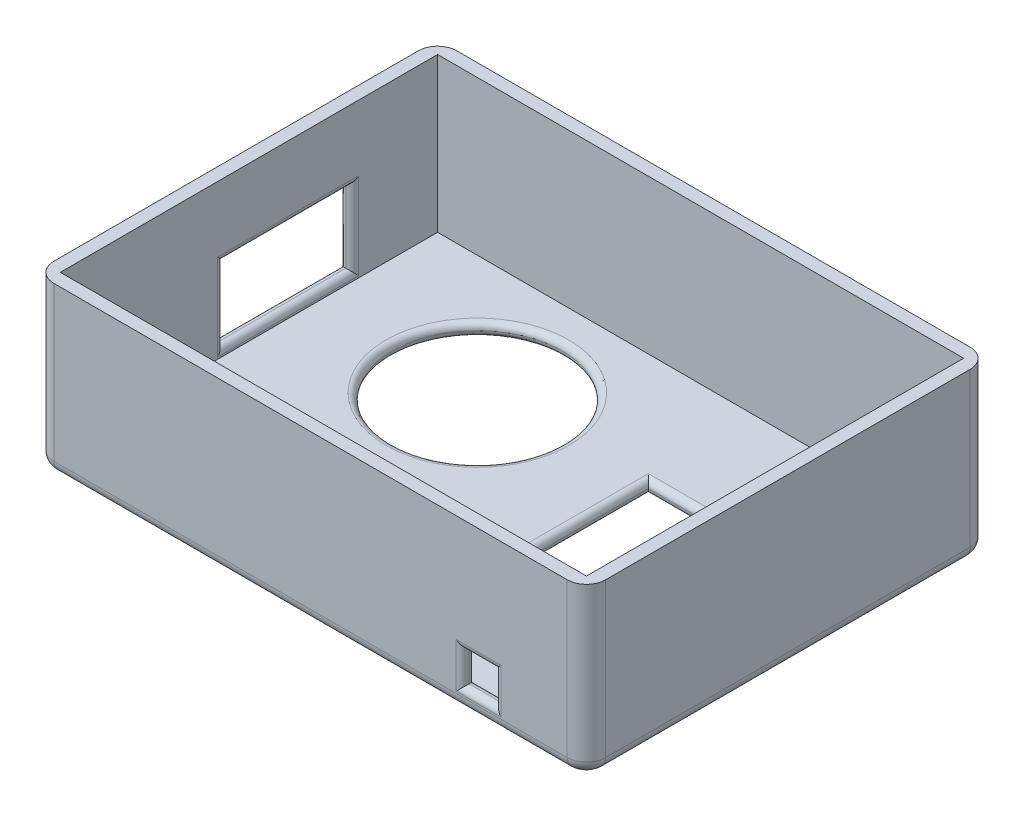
ISO-10303-21;
HEADER;
FILE_DESCRIPTION(('STEP AP214'),'2;1');
FILE_NAME('part.step','',(''),(''),'','','');
FILE_SCHEMA(('AUTOMOTIVE_DESIGN { 1 0 10303 214 1 1 1 1 }'));
ENDSEC;
DATA;
#1=APPLICATION_CONTEXT('core data for automotive mechanical design processes');
#2=APPLICATION_PROTOCOL_DEFINITION('international standard','automotive_design',2000,#1);
#3=PRODUCT_CONTEXT('',#1,'mechanical');
#4=PRODUCT('Part','Part','',(#3));
#5=PRODUCT_RELATED_PRODUCT_CATEGORY('part','',(#4));
#6=PRODUCT_DEFINITION_FORMATION('','',#4);
#7=PRODUCT_DEFINITION_CONTEXT('part definition',#1,'design');
#8=PRODUCT_DEFINITION('design','',#6,#7);
#9=PRODUCT_DEFINITION_SHAPE('','',#8);
#10=(LENGTH_UNIT() NAMED_UNIT(*) SI_UNIT(.MILLI.,.METRE.));
#11=(NAMED_UNIT(*) PLANE_ANGLE_UNIT() SI_UNIT($,.RADIAN.));
#12=(NAMED_UNIT(*) SI_UNIT($,.STERADIAN.) SOLID_ANGLE_UNIT());
#13=UNCERTAINTY_MEASURE_WITH_UNIT(LENGTH_MEASURE(1.E-05),#10,'distance_accuracy_value','');
#14=(GEOMETRIC_REPRESENTATION_CONTEXT(3) GLOBAL_UNCERTAINTY_ASSIGNED_CONTEXT((#13)) GLOBAL_UNIT_ASSIGNED_CONTEXT((#10,
#11,#12)) REPRESENTATION_CONTEXT('',''));
#15=CARTESIAN_POINT('',(0.,0.,0.));
#16=DIRECTION('',(0.,0.,1.));
#17=DIRECTION('',(1.,0.,0.));
#18=AXIS2_PLACEMENT_3D('',#15,#16,#17);
#19=CARTESIAN_POINT('',(0.,2.,0.));
#20=DIRECTION('',(0.,1.,0.));
#21=DIRECTION('',(0.,0.,1.));
#22=AXIS2_PLACEMENT_3D('',#19,#20,#21);
#23=PLANE('',#22);
#24=CARTESIAN_POINT('',(-24.0169790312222,2.,-11.2489790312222));
#25=DIRECTION('',(0.,1.,0.));
#26=DIRECTION('',(0.,0.,1.));
#27=AXIS2_PLACEMENT_3D('',#24,#25,#26);
#28=CIRCLE('',#27,14.2489790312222);
#29=CARTESIAN_POINT('',(-24.0169790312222,2.,3.));
#30=VERTEX_POINT('',#29);
#31=EDGE_CURVE('E997',#30,#30,#28,.F.);
#32=ORIENTED_EDGE('',*,*,#31,.T.);
#33=EDGE_LOOP('',(#32));
#34=FACE_BOUND('',#33,.T.);
#35=DIRECTION('',(0.,0.,1.));
#36=VECTOR('',#35,1.);
#37=CARTESIAN_POINT('',(0.231999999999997,2.,0.));
#38=LINE('',#37,#36);
#39=CARTESIAN_POINT('',(0.232,2.,24.));
#40=VERTEX_POINT('',#39);
#41=CARTESIAN_POINT('',(0.231999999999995,2.,-13.6479580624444));
#42=VERTEX_POINT('',#41);
#43=EDGE_CURVE('E981',#40,#42,#38,.F.);
#44=ORIENTED_EDGE('',*,*,#43,.T.);
#45=DIRECTION('',(1.,0.,0.));
#46=VECTOR('',#45,1.);
#47=CARTESIAN_POINT('',(18.732,2.,-13.6479580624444));
#48=LINE('',#47,#46);
#49=CARTESIAN_POINT('',(19.732,2.,-13.6479580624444));
#50=VERTEX_POINT('',#49);
#51=EDGE_CURVE('E993',#42,#50,#48,.T.);
#52=ORIENTED_EDGE('',*,*,#51,.T.);
#53=DIRECTION('',(0.,0.,1.));
#54=VECTOR('',#53,1.);
#55=CARTESIAN_POINT('',(19.732,2.,23.));
#56=LINE('',#55,#54);
#57=CARTESIAN_POINT('',(19.732,2.,24.));
#58=VERTEX_POINT('',#57);
#59=EDGE_CURVE('E989',#50,#58,#56,.T.);
#60=ORIENTED_EDGE('',*,*,#59,.T.);
#61=DIRECTION('',(1.,0.,0.));
#62=VECTOR('',#61,1.);
#63=CARTESIAN_POINT('',(0.,2.,24.));
#64=LINE('',#63,#62);
#65=EDGE_CURVE('E985',#58,#40,#64,.F.);
#66=ORIENTED_EDGE('',*,*,#65,.T.);
#67=EDGE_LOOP('',(#44,#52,#60,#66));
#68=FACE_BOUND('',#67,.T.);
#69=DIRECTION('',(0.,0.,-1.));
#70=VECTOR('',#69,1.);
#71=CARTESIAN_POINT('',(-48.768,2.,0.));
#72=LINE('',#71,#70);
#73=CARTESIAN_POINT('',(-48.768,2.00000000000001,29.));
#74=VERTEX_POINT('',#73);
#75=CARTESIAN_POINT('',(-48.768,2.,-29.7979580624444));
#76=VERTEX_POINT('',#75);
#77=EDGE_CURVE('E807',#74,#76,#72,.T.);
#78=ORIENTED_EDGE('',*,*,#77,.F.);
#79=DIRECTION('',(-1.,0.,0.));
#80=VECTOR('',#79,1.);
#81=CARTESIAN_POINT('',(0.,2.,29.));
#82=LINE('',#81,#80);
#83=CARTESIAN_POINT('',(33.232,2.00000000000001,29.));
#84=VERTEX_POINT('',#83);
#85=EDGE_CURVE('E811',#84,#74,#82,.T.);
#86=ORIENTED_EDGE('',*,*,#85,.F.);
#87=DIRECTION('',(0.,0.,-1.));
#88=VECTOR('',#87,1.);
#89=CARTESIAN_POINT('',(33.232,2.,0.));
#90=LINE('',#89,#88);
#91=CARTESIAN_POINT('',(33.232,2.00000000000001,-29.7979580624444));
#92=VERTEX_POINT('',#91);
#93=EDGE_CURVE('E815',#84,#92,#90,.T.);
#94=ORIENTED_EDGE('',*,*,#93,.T.);
#95=DIRECTION('',(-1.,0.,0.));
#96=VECTOR('',#95,1.);
#97=CARTESIAN_POINT('',(0.,2.,-29.7979580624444));
#98=LINE('',#97,#96);
#99=EDGE_CURVE('E819',#92,#76,#98,.T.);
#100=ORIENTED_EDGE('',*,*,#99,.T.);
#101=EDGE_LOOP('',(#78,#86,#94,#100));
#102=FACE_BOUND('',#101,.T.);
#103=ADVANCED_FACE('F43',(#34,#68,#102),#23,.T.);
#104=CARTESIAN_POINT('',(0.,0.,0.));
#105=DIRECTION('',(0.,1.,0.));
#106=DIRECTION('',(0.,0.,1.));
#107=AXIS2_PLACEMENT_3D('',#104,#105,#106);
#108=PLANE('',#107);
#109=CARTESIAN_POINT('',(-24.0169790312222,0.,-11.2489790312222));
#110=DIRECTION('',(0.,1.,0.));
#111=DIRECTION('',(0.,0.,1.));
#112=AXIS2_PLACEMENT_3D('',#109,#110,#111);
#113=CIRCLE('',#112,14.2489790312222);
#114=CARTESIAN_POINT('',(-24.0169790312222,0.,3.));
#115=VERTEX_POINT('',#114);
#116=EDGE_CURVE('E1047',#115,#115,#113,.T.);
#117=ORIENTED_EDGE('',*,*,#116,.T.);
#118=EDGE_LOOP('',(#117));
#119=FACE_BOUND('',#118,.T.);
#120=DIRECTION('',(0.,0.,1.));
#121=VECTOR('',#120,1.);
#122=CARTESIAN_POINT('',(19.732,0.,0.));
#123=LINE('',#122,#121);
#124=CARTESIAN_POINT('',(19.732,0.,24.));
#125=VERTEX_POINT('',#124);
#126=CARTESIAN_POINT('',(19.732,0.,-13.6479580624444));
#127=VERTEX_POINT('',#126);
#128=EDGE_CURVE('E973',#125,#127,#123,.F.);
#129=ORIENTED_EDGE('',*,*,#128,.T.);
#130=DIRECTION('',(1.,0.,0.));
#131=VECTOR('',#130,1.);
#132=CARTESIAN_POINT('',(0.,0.,-13.6479580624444));
#133=LINE('',#132,#131);
#134=CARTESIAN_POINT('',(0.231999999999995,0.,-13.6479580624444));
#135=VERTEX_POINT('',#134);
#136=EDGE_CURVE('E977',#127,#135,#133,.F.);
#137=ORIENTED_EDGE('',*,*,#136,.T.);
#138=DIRECTION('',(0.,0.,1.));
#139=VECTOR('',#138,1.);
#140=CARTESIAN_POINT('',(0.232,0.,23.));
#141=LINE('',#140,#139);
#142=CARTESIAN_POINT('',(0.232,0.,24.));
#143=VERTEX_POINT('',#142);
#144=EDGE_CURVE('E933',#135,#143,#141,.T.);
#145=ORIENTED_EDGE('',*,*,#144,.T.);
#146=DIRECTION('',(1.,0.,0.));
#147=VECTOR('',#146,1.);
#148=CARTESIAN_POINT('',(18.732,0.,24.));
#149=LINE('',#148,#147);
#150=EDGE_CURVE('E969',#143,#125,#149,.T.);
#151=ORIENTED_EDGE('',*,*,#150,.T.);
#152=EDGE_LOOP('',(#129,#137,#145,#151));
#153=FACE_BOUND('',#152,.T.);
#154=CARTESIAN_POINT('',(-47.768,0.,28.));
#155=DIRECTION('',(0.,1.,0.));
#156=DIRECTION('',(0.,0.,1.));
#157=AXIS2_PLACEMENT_3D('',#154,#155,#156);
#158=CIRCLE('',#157,1.);
#159=CARTESIAN_POINT('',(-47.768,0.,29.));
#160=VERTEX_POINT('',#159);
#161=CARTESIAN_POINT('',(-48.768,0.,28.));
#162=VERTEX_POINT('',#161);
#163=EDGE_CURVE('E893',#160,#162,#158,.F.);
#164=ORIENTED_EDGE('',*,*,#163,.T.);
#165=DIRECTION('',(0.,0.,1.));
#166=VECTOR('',#165,1.);
#167=CARTESIAN_POINT('',(-48.768,0.,0.));
#168=LINE('',#167,#166);
#169=CARTESIAN_POINT('',(-48.768,0.,-28.7979580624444));
#170=VERTEX_POINT('',#169);
#171=EDGE_CURVE('E897',#162,#170,#168,.F.);
#172=ORIENTED_EDGE('',*,*,#171,.T.);
#173=CARTESIAN_POINT('',(-47.768,0.,-28.7979580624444));
#174=DIRECTION('',(0.,1.,0.));
#175=DIRECTION('',(0.,0.,1.));
#176=AXIS2_PLACEMENT_3D('',#173,#174,#175);
#177=CIRCLE('',#176,1.);
#178=CARTESIAN_POINT('',(-47.768,0.,-29.7979580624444));
#179=VERTEX_POINT('',#178);
#180=EDGE_CURVE('E889',#170,#179,#177,.F.);
#181=ORIENTED_EDGE('',*,*,#180,.T.);
#182=DIRECTION('',(-1.,0.,0.));
#183=VECTOR('',#182,1.);
#184=CARTESIAN_POINT('',(0.,0.,-29.7979580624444));
#185=LINE('',#184,#183);
#186=CARTESIAN_POINT('',(32.232,0.,-29.7979580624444));
#187=VERTEX_POINT('',#186);
#188=EDGE_CURVE('E885',#179,#187,#185,.F.);
#189=ORIENTED_EDGE('',*,*,#188,.T.);
#190=CARTESIAN_POINT('',(32.232,0.,-28.7979580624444));
#191=DIRECTION('',(0.,1.,0.));
#192=DIRECTION('',(0.,0.,1.));
#193=AXIS2_PLACEMENT_3D('',#190,#191,#192);
#194=CIRCLE('',#193,1.);
#195=CARTESIAN_POINT('',(33.232,0.,-28.7979580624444));
#196=VERTEX_POINT('',#195);
#197=EDGE_CURVE('E873',#187,#196,#194,.F.);
#198=ORIENTED_EDGE('',*,*,#197,.T.);
#199=DIRECTION('',(0.,0.,-1.));
#200=VECTOR('',#199,1.);
#201=CARTESIAN_POINT('',(33.232,0.,0.));
#202=LINE('',#201,#200);
#203=CARTESIAN_POINT('',(33.232,0.,28.));
#204=VERTEX_POINT('',#203);
#205=EDGE_CURVE('E869',#196,#204,#202,.F.);
#206=ORIENTED_EDGE('',*,*,#205,.T.);
#207=CARTESIAN_POINT('',(32.232,0.,28.));
#208=DIRECTION('',(0.,1.,0.));
#209=DIRECTION('',(0.,0.,1.));
#210=AXIS2_PLACEMENT_3D('',#207,#208,#209);
#211=CIRCLE('',#210,1.);
#212=CARTESIAN_POINT('',(32.232,0.,29.));
#213=VERTEX_POINT('',#212);
#214=EDGE_CURVE('E877',#204,#213,#211,.F.);
#215=ORIENTED_EDGE('',*,*,#214,.T.);
#216=DIRECTION('',(1.,0.,0.));
#217=VECTOR('',#216,1.);
#218=CARTESIAN_POINT('',(0.,0.,29.));
#219=LINE('',#218,#217);
#220=EDGE_CURVE('E881',#213,#160,#219,.F.);
#221=ORIENTED_EDGE('',*,*,#220,.T.);
#222=EDGE_LOOP('',(#164,#172,#181,#189,#198,#206,#215,#221));
#223=FACE_BOUND('',#222,.T.);
#224=ADVANCED_FACE('F157',(#119,#153,#223),#108,.F.);
#225=CARTESIAN_POINT('',(0.,26.,0.));
#226=DIRECTION('',(0.,1.,0.));
#227=DIRECTION('',(0.,0.,1.));
#228=AXIS2_PLACEMENT_3D('',#225,#226,#227);
#229=PLANE('',#228);
#230=DIRECTION('',(0.,0.,1.));
#231=VECTOR('',#230,1.);
#232=CARTESIAN_POINT('',(-50.768,26.,-31.7979580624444));
#233=LINE('',#232,#231);
#234=CARTESIAN_POINT('',(-50.768,26.,-28.7979580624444));
#235=VERTEX_POINT('',#234);
#236=CARTESIAN_POINT('',(-50.768,26.,28.));
#237=VERTEX_POINT('',#236);
#238=EDGE_CURVE('E746',#235,#237,#233,.T.);
#239=ORIENTED_EDGE('',*,*,#238,.T.);
#240=CARTESIAN_POINT('',(-47.768,26.,28.));
#241=DIRECTION('',(0.,1.,0.));
#242=DIRECTION('',(0.,0.,1.));
#243=AXIS2_PLACEMENT_3D('',#240,#241,#242);
#244=CIRCLE('',#243,3.);
#245=CARTESIAN_POINT('',(-47.768,26.,31.));
#246=VERTEX_POINT('',#245);
#247=EDGE_CURVE('E850',#237,#246,#244,.T.);
#248=ORIENTED_EDGE('',*,*,#247,.T.);
#249=DIRECTION('',(1.,0.,0.));
#250=VECTOR('',#249,1.);
#251=CARTESIAN_POINT('',(-50.768,26.,31.));
#252=LINE('',#251,#250);
#253=CARTESIAN_POINT('',(32.232,26.,31.));
#254=VERTEX_POINT('',#253);
#255=EDGE_CURVE('E795',#246,#254,#252,.T.);
#256=ORIENTED_EDGE('',*,*,#255,.T.);
#257=CARTESIAN_POINT('',(32.232,26.,28.));
#258=DIRECTION('',(0.,1.,0.));
#259=DIRECTION('',(0.,0.,1.));
#260=AXIS2_PLACEMENT_3D('',#257,#258,#259);
#261=CIRCLE('',#260,3.);
#262=CARTESIAN_POINT('',(35.232,26.,28.));
#263=VERTEX_POINT('',#262);
#264=EDGE_CURVE('E846',#254,#263,#261,.T.);
#265=ORIENTED_EDGE('',*,*,#264,.T.);
#266=DIRECTION('',(0.,0.,-1.));
#267=VECTOR('',#266,1.);
#268=CARTESIAN_POINT('',(35.232,26.,-31.7979580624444));
#269=LINE('',#268,#267);
#270=CARTESIAN_POINT('',(35.232,26.,-28.7979580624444));
#271=VERTEX_POINT('',#270);
#272=EDGE_CURVE('E799',#263,#271,#269,.T.);
#273=ORIENTED_EDGE('',*,*,#272,.T.);
#274=CARTESIAN_POINT('',(32.232,26.,-28.7979580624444));
#275=DIRECTION('',(0.,1.,0.));
#276=DIRECTION('',(0.,0.,1.));
#277=AXIS2_PLACEMENT_3D('',#274,#275,#276);
#278=CIRCLE('',#277,3.);
#279=CARTESIAN_POINT('',(32.232,26.,-31.7979580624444));
#280=VERTEX_POINT('',#279);
#281=EDGE_CURVE('E842',#271,#280,#278,.T.);
#282=ORIENTED_EDGE('',*,*,#281,.T.);
#283=DIRECTION('',(-1.,0.,0.));
#284=VECTOR('',#283,1.);
#285=CARTESIAN_POINT('',(-50.768,26.,-31.7979580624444));
#286=LINE('',#285,#284);
#287=CARTESIAN_POINT('',(-47.768,26.,-31.7979580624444));
#288=VERTEX_POINT('',#287);
#289=EDGE_CURVE('E803',#280,#288,#286,.T.);
#290=ORIENTED_EDGE('',*,*,#289,.T.);
#291=CARTESIAN_POINT('',(-47.768,26.,-28.7979580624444));
#292=DIRECTION('',(0.,1.,0.));
#293=DIRECTION('',(0.,0.,1.));
#294=AXIS2_PLACEMENT_3D('',#291,#292,#293);
#295=CIRCLE('',#294,3.);
#296=EDGE_CURVE('E839',#288,#235,#295,.T.);
#297=ORIENTED_EDGE('',*,*,#296,.T.);
#298=EDGE_LOOP('',(#239,#248,#256,#265,#273,#282,#290,#297));
#299=FACE_BOUND('',#298,.T.);
#300=DIRECTION('',(1.,0.,0.));
#301=VECTOR('',#300,1.);
#302=CARTESIAN_POINT('',(-48.768,26.,29.));
#303=LINE('',#302,#301);
#304=CARTESIAN_POINT('',(-48.768,26.,29.));
#305=VERTEX_POINT('',#304);
#306=CARTESIAN_POINT('',(33.232,26.,29.));
#307=VERTEX_POINT('',#306);
#308=EDGE_CURVE('E753',#305,#307,#303,.T.);
#309=ORIENTED_EDGE('',*,*,#308,.F.);
#310=DIRECTION('',(0.,0.,1.));
#311=VECTOR('',#310,1.);
#312=CARTESIAN_POINT('',(-48.768,26.,-29.7979580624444));
#313=LINE('',#312,#311);
#314=CARTESIAN_POINT('',(-48.768,26.,-29.7979580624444));
#315=VERTEX_POINT('',#314);
#316=EDGE_CURVE('E757',#315,#305,#313,.T.);
#317=ORIENTED_EDGE('',*,*,#316,.F.);
#318=DIRECTION('',(-1.,0.,0.));
#319=VECTOR('',#318,1.);
#320=CARTESIAN_POINT('',(-48.768,26.,-29.7979580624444));
#321=LINE('',#320,#319);
#322=CARTESIAN_POINT('',(33.232,26.,-29.7979580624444));
#323=VERTEX_POINT('',#322);
#324=EDGE_CURVE('E770',#323,#315,#321,.T.);
#325=ORIENTED_EDGE('',*,*,#324,.F.);
#326=DIRECTION('',(0.,0.,-1.));
#327=VECTOR('',#326,1.);
#328=CARTESIAN_POINT('',(33.232,26.,-29.7979580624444));
#329=LINE('',#328,#327);
#330=EDGE_CURVE('E760',#307,#323,#329,.T.);
#331=ORIENTED_EDGE('',*,*,#330,.F.);
#332=EDGE_LOOP('',(#309,#317,#325,#331));
#333=FACE_BOUND('',#332,.T.);
#334=ADVANCED_FACE('F163',(#299,#333),#229,.T.);
#335=CARTESIAN_POINT('',(-50.768,26.,-31.7979580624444));
#336=DIRECTION('',(1.,0.,0.));
#337=DIRECTION('',(0.,0.,-1.));
#338=AXIS2_PLACEMENT_3D('',#335,#336,#337);
#339=PLANE('',#338);
#340=DIRECTION('',(0.,0.,1.));
#341=VECTOR('',#340,1.);
#342=CARTESIAN_POINT('',(-50.768,2.3,-31.7979580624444));
#343=LINE('',#342,#341);
#344=CARTESIAN_POINT('',(-50.768,2.3,4.50204193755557));
#345=VERTEX_POINT('',#344);
#346=CARTESIAN_POINT('',(-50.768,2.3,-17.4979580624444));
#347=VERTEX_POINT('',#346);
#348=EDGE_CURVE('E1062',#345,#347,#343,.F.);
#349=ORIENTED_EDGE('',*,*,#348,.T.);
#350=DIRECTION('',(0.,-1.,0.));
#351=VECTOR('',#350,1.);
#352=CARTESIAN_POINT('',(-50.768,26.,-17.4979580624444));
#353=LINE('',#352,#351);
#354=CARTESIAN_POINT('',(-50.768,15.8,-17.4979580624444));
#355=VERTEX_POINT('',#354);
#356=EDGE_CURVE('E1066',#347,#355,#353,.F.);
#357=ORIENTED_EDGE('',*,*,#356,.T.);
#358=DIRECTION('',(0.,0.,-1.));
#359=VECTOR('',#358,1.);
#360=CARTESIAN_POINT('',(-50.768,15.8,-31.7979580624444));
#361=LINE('',#360,#359);
#362=CARTESIAN_POINT('',(-50.768,15.8,4.50204193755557));
#363=VERTEX_POINT('',#362);
#364=EDGE_CURVE('E1051',#355,#363,#361,.F.);
#365=ORIENTED_EDGE('',*,*,#364,.T.);
#366=DIRECTION('',(0.,1.,0.));
#367=VECTOR('',#366,1.);
#368=CARTESIAN_POINT('',(-50.768,26.,4.50204193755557));
#369=LINE('',#368,#367);
#370=EDGE_CURVE('E1058',#363,#345,#369,.F.);
#371=ORIENTED_EDGE('',*,*,#370,.T.);
#372=EDGE_LOOP('',(#349,#357,#365,#371));
#373=FACE_BOUND('',#372,.T.);
#374=DIRECTION('',(0.,-1.,0.));
#375=VECTOR('',#374,1.);
#376=CARTESIAN_POINT('',(-50.768,26.,-28.7979580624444));
#377=LINE('',#376,#375);
#378=CARTESIAN_POINT('',(-50.768,2.,-28.7979580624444));
#379=VERTEX_POINT('',#378);
#380=EDGE_CURVE('E831',#235,#379,#377,.T.);
#381=ORIENTED_EDGE('',*,*,#380,.T.);
#382=DIRECTION('',(0.,0.,1.));
#383=VECTOR('',#382,1.);
#384=CARTESIAN_POINT('',(-50.768,2.,-31.7979580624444));
#385=LINE('',#384,#383);
#386=CARTESIAN_POINT('',(-50.768,2.,28.));
#387=VERTEX_POINT('',#386);
#388=EDGE_CURVE('E921',#379,#387,#385,.T.);
#389=ORIENTED_EDGE('',*,*,#388,.T.);
#390=DIRECTION('',(0.,-1.,0.));
#391=VECTOR('',#390,1.);
#392=CARTESIAN_POINT('',(-50.768,26.,28.));
#393=LINE('',#392,#391);
#394=EDGE_CURVE('E835',#387,#237,#393,.F.);
#395=ORIENTED_EDGE('',*,*,#394,.T.);
#396=ORIENTED_EDGE('',*,*,#238,.F.);
#397=EDGE_LOOP('',(#381,#389,#395,#396));
#398=FACE_BOUND('',#397,.T.);
#399=ADVANCED_FACE('F169',(#373,#398),#339,.F.);
#400=CARTESIAN_POINT('',(-50.768,26.,31.));
#401=DIRECTION('',(0.,0.,-1.));
#402=DIRECTION('',(-1.,0.,0.));
#403=AXIS2_PLACEMENT_3D('',#400,#401,#402);
#404=PLANE('',#403);
#405=DIRECTION('',(1.,0.,0.));
#406=VECTOR('',#405,1.);
#407=CARTESIAN_POINT('',(-50.768,2.3,31.));
#408=LINE('',#407,#406);
#409=CARTESIAN_POINT('',(21.932,2.3,31.));
#410=VERTEX_POINT('',#409);
#411=CARTESIAN_POINT('',(14.932,2.3,31.));
#412=VERTEX_POINT('',#411);
#413=EDGE_CURVE('E320',#410,#412,#408,.F.);
#414=ORIENTED_EDGE('',*,*,#413,.T.);
#415=DIRECTION('',(0.,-1.,0.));
#416=VECTOR('',#415,1.);
#417=CARTESIAN_POINT('',(14.932,26.,31.));
#418=LINE('',#417,#416);
#419=CARTESIAN_POINT('',(14.932,9.3,31.));
#420=VERTEX_POINT('',#419);
#421=EDGE_CURVE('E131',#412,#420,#418,.F.);
#422=ORIENTED_EDGE('',*,*,#421,.T.);
#423=DIRECTION('',(-1.,0.,0.));
#424=VECTOR('',#423,1.);
#425=CARTESIAN_POINT('',(-50.768,9.3,31.));
#426=LINE('',#425,#424);
#427=CARTESIAN_POINT('',(21.932,9.3,31.));
#428=VERTEX_POINT('',#427);
#429=EDGE_CURVE('E308',#420,#428,#426,.F.);
#430=ORIENTED_EDGE('',*,*,#429,.T.);
#431=DIRECTION('',(0.,1.,0.));
#432=VECTOR('',#431,1.);
#433=CARTESIAN_POINT('',(21.932,25.9999999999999,31.));
#434=LINE('',#433,#432);
#435=EDGE_CURVE('E314',#428,#410,#434,.F.);
#436=ORIENTED_EDGE('',*,*,#435,.T.);
#437=EDGE_LOOP('',(#414,#422,#430,#436));
#438=FACE_BOUND('',#437,.T.);
#439=DIRECTION('',(0.,-1.,0.));
#440=VECTOR('',#439,1.);
#441=CARTESIAN_POINT('',(-47.768,26.,31.));
#442=LINE('',#441,#440);
#443=CARTESIAN_POINT('',(-47.768,2.,31.));
#444=VERTEX_POINT('',#443);
#445=EDGE_CURVE('E827',#246,#444,#442,.T.);
#446=ORIENTED_EDGE('',*,*,#445,.T.);
#447=DIRECTION('',(1.,0.,0.));
#448=VECTOR('',#447,1.);
#449=CARTESIAN_POINT('',(-50.768,2.,31.));
#450=LINE('',#449,#448);
#451=CARTESIAN_POINT('',(32.232,2.,31.));
#452=VERTEX_POINT('',#451);
#453=EDGE_CURVE('E925',#444,#452,#450,.T.);
#454=ORIENTED_EDGE('',*,*,#453,.T.);
#455=DIRECTION('',(0.,-1.,0.));
#456=VECTOR('',#455,1.);
#457=CARTESIAN_POINT('',(32.232,26.,31.));
#458=LINE('',#457,#456);
#459=EDGE_CURVE('E823',#452,#254,#458,.F.);
#460=ORIENTED_EDGE('',*,*,#459,.T.);
#461=ORIENTED_EDGE('',*,*,#255,.F.);
#462=EDGE_LOOP('',(#446,#454,#460,#461));
#463=FACE_BOUND('',#462,.T.);
#464=ADVANCED_FACE('F317',(#438,#463),#404,.F.);
#465=CARTESIAN_POINT('',(35.232,26.,-31.7979580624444));
#466=DIRECTION('',(-1.,0.,0.));
#467=DIRECTION('',(0.,0.,1.));
#468=AXIS2_PLACEMENT_3D('',#465,#466,#467);
#469=PLANE('',#468);
#470=DIRECTION('',(0.,-1.,0.));
#471=VECTOR('',#470,1.);
#472=CARTESIAN_POINT('',(35.232,26.,28.));
#473=LINE('',#472,#471);
#474=CARTESIAN_POINT('',(35.232,2.,28.));
#475=VERTEX_POINT('',#474);
#476=EDGE_CURVE('E857',#263,#475,#473,.T.);
#477=ORIENTED_EDGE('',*,*,#476,.T.);
#478=DIRECTION('',(0.,0.,-1.));
#479=VECTOR('',#478,1.);
#480=CARTESIAN_POINT('',(35.232,2.,-31.7979580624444));
#481=LINE('',#480,#479);
#482=CARTESIAN_POINT('',(35.232,2.,-28.7979580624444));
#483=VERTEX_POINT('',#482);
#484=EDGE_CURVE('E929',#475,#483,#481,.T.);
#485=ORIENTED_EDGE('',*,*,#484,.T.);
#486=DIRECTION('',(0.,-1.,0.));
#487=VECTOR('',#486,1.);
#488=CARTESIAN_POINT('',(35.232,26.,-28.7979580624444));
#489=LINE('',#488,#487);
#490=EDGE_CURVE('E853',#483,#271,#489,.F.);
#491=ORIENTED_EDGE('',*,*,#490,.T.);
#492=ORIENTED_EDGE('',*,*,#272,.F.);
#493=EDGE_LOOP('',(#477,#485,#491,#492));
#494=FACE_BOUND('',#493,.T.);
#495=ADVANCED_FACE('F660',(#494),#469,.F.);
#496=CARTESIAN_POINT('',(-50.768,26.,-31.7979580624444));
#497=DIRECTION('',(0.,0.,1.));
#498=DIRECTION('',(1.,0.,0.));
#499=AXIS2_PLACEMENT_3D('',#496,#497,#498);
#500=PLANE('',#499);
#501=DIRECTION('',(0.,-1.,0.));
#502=VECTOR('',#501,1.);
#503=CARTESIAN_POINT('',(32.232,26.,-31.7979580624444));
#504=LINE('',#503,#502);
#505=CARTESIAN_POINT('',(32.232,2.,-31.7979580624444));
#506=VERTEX_POINT('',#505);
#507=EDGE_CURVE('E865',#280,#506,#504,.T.);
#508=ORIENTED_EDGE('',*,*,#507,.T.);
#509=DIRECTION('',(-1.,0.,0.));
#510=VECTOR('',#509,1.);
#511=CARTESIAN_POINT('',(-50.768,2.,-31.7979580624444));
#512=LINE('',#511,#510);
#513=CARTESIAN_POINT('',(-47.768,2.,-31.7979580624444));
#514=VERTEX_POINT('',#513);
#515=EDGE_CURVE('E917',#506,#514,#512,.T.);
#516=ORIENTED_EDGE('',*,*,#515,.T.);
#517=DIRECTION('',(0.,-1.,0.));
#518=VECTOR('',#517,1.);
#519=CARTESIAN_POINT('',(-47.768,26.,-31.7979580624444));
#520=LINE('',#519,#518);
#521=EDGE_CURVE('E861',#514,#288,#520,.F.);
#522=ORIENTED_EDGE('',*,*,#521,.T.);
#523=ORIENTED_EDGE('',*,*,#289,.F.);
#524=EDGE_LOOP('',(#508,#516,#522,#523));
#525=FACE_BOUND('',#524,.T.);
#526=ADVANCED_FACE('F652',(#525),#500,.F.);
#527=CARTESIAN_POINT('',(-48.768,26.,-29.7979580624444));
#528=DIRECTION('',(1.,0.,0.));
#529=DIRECTION('',(0.,0.,-1.));
#530=AXIS2_PLACEMENT_3D('',#527,#528,#529);
#531=PLANE('',#530);
#532=DIRECTION('',(0.,0.,1.));
#533=VECTOR('',#532,1.);
#534=CARTESIAN_POINT('',(-48.768,15.8,-16.4979580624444));
#535=LINE('',#534,#533);
#536=CARTESIAN_POINT('',(-48.768,15.8,4.50204193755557));
#537=VERTEX_POINT('',#536);
#538=CARTESIAN_POINT('',(-48.768,15.8,-17.4979580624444));
#539=VERTEX_POINT('',#538);
#540=EDGE_CURVE('E1070',#537,#539,#535,.F.);
#541=ORIENTED_EDGE('',*,*,#540,.T.);
#542=DIRECTION('',(0.,1.,0.));
#543=VECTOR('',#542,1.);
#544=CARTESIAN_POINT('',(-48.768,3.3,-17.4979580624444));
#545=LINE('',#544,#543);
#546=CARTESIAN_POINT('',(-48.768,2.3,-17.4979580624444));
#547=VERTEX_POINT('',#546);
#548=EDGE_CURVE('E315',#539,#547,#545,.F.);
#549=ORIENTED_EDGE('',*,*,#548,.T.);
#550=DIRECTION('',(0.,0.,-1.));
#551=VECTOR('',#550,1.);
#552=CARTESIAN_POINT('',(-48.768,2.3,3.50204193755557));
#553=LINE('',#552,#551);
#554=CARTESIAN_POINT('',(-48.768,2.3,4.50204193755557));
#555=VERTEX_POINT('',#554);
#556=EDGE_CURVE('E1077',#547,#555,#553,.F.);
#557=ORIENTED_EDGE('',*,*,#556,.T.);
#558=DIRECTION('',(0.,-1.,0.));
#559=VECTOR('',#558,1.);
#560=CARTESIAN_POINT('',(-48.768,14.8,4.50204193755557));
#561=LINE('',#560,#559);
#562=EDGE_CURVE('E1074',#555,#537,#561,.F.);
#563=ORIENTED_EDGE('',*,*,#562,.T.);
#564=EDGE_LOOP('',(#541,#549,#557,#563));
#565=FACE_BOUND('',#564,.T.);
#566=DIRECTION('',(0.,-1.,0.));
#567=VECTOR('',#566,1.);
#568=CARTESIAN_POINT('',(-48.768,26.,29.));
#569=LINE('',#568,#567);
#570=EDGE_CURVE('E789',#305,#74,#569,.T.);
#571=ORIENTED_EDGE('',*,*,#570,.T.);
#572=ORIENTED_EDGE('',*,*,#77,.T.);
#573=DIRECTION('',(0.,-1.,0.));
#574=VECTOR('',#573,1.);
#575=CARTESIAN_POINT('',(-48.768,26.,-29.7979580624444));
#576=LINE('',#575,#574);
#577=EDGE_CURVE('E778',#315,#76,#576,.T.);
#578=ORIENTED_EDGE('',*,*,#577,.F.);
#579=ORIENTED_EDGE('',*,*,#316,.T.);
#580=EDGE_LOOP('',(#571,#572,#578,#579));
#581=FACE_BOUND('',#580,.T.);
#582=ADVANCED_FACE('F645',(#565,#581),#531,.T.);
#583=CARTESIAN_POINT('',(-48.768,26.,29.));
#584=DIRECTION('',(0.,0.,-1.));
#585=DIRECTION('',(-1.,0.,0.));
#586=AXIS2_PLACEMENT_3D('',#583,#584,#585);
#587=PLANE('',#586);
#588=DIRECTION('',(1.,0.,0.));
#589=VECTOR('',#588,1.);
#590=CARTESIAN_POINT('',(15.932,9.3,29.));
#591=LINE('',#590,#589);
#592=CARTESIAN_POINT('',(21.932,9.3,29.));
#593=VERTEX_POINT('',#592);
#594=CARTESIAN_POINT('',(14.932,9.3,29.));
#595=VERTEX_POINT('',#594);
#596=EDGE_CURVE('E125',#593,#595,#591,.F.);
#597=ORIENTED_EDGE('',*,*,#596,.T.);
#598=DIRECTION('',(0.,1.,0.));
#599=VECTOR('',#598,1.);
#600=CARTESIAN_POINT('',(14.932,3.3,29.));
#601=LINE('',#600,#599);
#602=CARTESIAN_POINT('',(14.932,2.3,29.));
#603=VERTEX_POINT('',#602);
#604=EDGE_CURVE('E11',#595,#603,#601,.F.);
#605=ORIENTED_EDGE('',*,*,#604,.T.);
#606=DIRECTION('',(-1.,0.,0.));
#607=VECTOR('',#606,1.);
#608=CARTESIAN_POINT('',(20.932,2.3,29.));
#609=LINE('',#608,#607);
#610=CARTESIAN_POINT('',(21.932,2.3,29.));
#611=VERTEX_POINT('',#610);
#612=EDGE_CURVE('E54',#603,#611,#609,.F.);
#613=ORIENTED_EDGE('',*,*,#612,.T.);
#614=DIRECTION('',(0.,-1.,0.));
#615=VECTOR('',#614,1.);
#616=CARTESIAN_POINT('',(21.932,8.3,29.));
#617=LINE('',#616,#615);
#618=EDGE_CURVE('E129',#611,#593,#617,.F.);
#619=ORIENTED_EDGE('',*,*,#618,.T.);
#620=EDGE_LOOP('',(#597,#605,#613,#619));
#621=FACE_BOUND('',#620,.T.);
#622=DIRECTION('',(0.,-1.,0.));
#623=VECTOR('',#622,1.);
#624=CARTESIAN_POINT('',(33.232,26.,29.));
#625=LINE('',#624,#623);
#626=EDGE_CURVE('E786',#307,#84,#625,.T.);
#627=ORIENTED_EDGE('',*,*,#626,.T.);
#628=ORIENTED_EDGE('',*,*,#85,.T.);
#629=ORIENTED_EDGE('',*,*,#570,.F.);
#630=ORIENTED_EDGE('',*,*,#308,.T.);
#631=EDGE_LOOP('',(#627,#628,#629,#630));
#632=FACE_BOUND('',#631,.T.);
#633=ADVANCED_FACE('F127',(#621,#632),#587,.T.);
#634=CARTESIAN_POINT('',(33.232,26.,-29.7979580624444));
#635=DIRECTION('',(-1.,0.,0.));
#636=DIRECTION('',(0.,0.,1.));
#637=AXIS2_PLACEMENT_3D('',#634,#635,#636);
#638=PLANE('',#637);
#639=DIRECTION('',(0.,-1.,0.));
#640=VECTOR('',#639,1.);
#641=CARTESIAN_POINT('',(33.232,26.,-29.7979580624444));
#642=LINE('',#641,#640);
#643=EDGE_CURVE('E782',#323,#92,#642,.T.);
#644=ORIENTED_EDGE('',*,*,#643,.T.);
#645=ORIENTED_EDGE('',*,*,#93,.F.);
#646=ORIENTED_EDGE('',*,*,#626,.F.);
#647=ORIENTED_EDGE('',*,*,#330,.T.);
#648=EDGE_LOOP('',(#644,#645,#646,#647));
#649=FACE_BOUND('',#648,.T.);
#650=ADVANCED_FACE('F628',(#649),#638,.T.);
#651=CARTESIAN_POINT('',(-48.768,26.,-29.7979580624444));
#652=DIRECTION('',(0.,0.,1.));
#653=DIRECTION('',(1.,0.,0.));
#654=AXIS2_PLACEMENT_3D('',#651,#652,#653);
#655=PLANE('',#654);
#656=ORIENTED_EDGE('',*,*,#577,.T.);
#657=ORIENTED_EDGE('',*,*,#99,.F.);
#658=ORIENTED_EDGE('',*,*,#643,.F.);
#659=ORIENTED_EDGE('',*,*,#324,.T.);
#660=EDGE_LOOP('',(#656,#657,#658,#659));
#661=FACE_BOUND('',#660,.T.);
#662=ADVANCED_FACE('F176',(#661),#655,.T.);
#663=CARTESIAN_POINT('',(-47.768,26.,28.));
#664=DIRECTION('',(0.,-1.,0.));
#665=DIRECTION('',(0.,0.,-1.));
#666=AXIS2_PLACEMENT_3D('',#663,#664,#665);
#667=CYLINDRICAL_SURFACE('',#666,3.);
#668=ORIENTED_EDGE('',*,*,#394,.F.);
#669=CARTESIAN_POINT('',(-47.768,2.,28.));
#670=DIRECTION('',(0.,1.,0.));
#671=DIRECTION('',(0.,0.,1.));
#672=AXIS2_PLACEMENT_3D('',#669,#670,#671);
#673=CIRCLE('',#672,3.);
#674=EDGE_CURVE('E905',#387,#444,#673,.T.);
#675=ORIENTED_EDGE('',*,*,#674,.T.);
#676=ORIENTED_EDGE('',*,*,#445,.F.);
#677=ORIENTED_EDGE('',*,*,#247,.F.);
#678=EDGE_LOOP('',(#668,#675,#676,#677));
#679=FACE_BOUND('',#678,.T.);
#680=ADVANCED_FACE('F172',(#679),#667,.T.);
#681=CARTESIAN_POINT('',(32.232,26.,28.));
#682=DIRECTION('',(0.,-1.,0.));
#683=DIRECTION('',(0.,0.,-1.));
#684=AXIS2_PLACEMENT_3D('',#681,#682,#683);
#685=CYLINDRICAL_SURFACE('',#684,3.);
#686=ORIENTED_EDGE('',*,*,#459,.F.);
#687=CARTESIAN_POINT('',(32.232,2.,28.));
#688=DIRECTION('',(0.,1.,0.));
#689=DIRECTION('',(0.,0.,1.));
#690=AXIS2_PLACEMENT_3D('',#687,#688,#689);
#691=CIRCLE('',#690,3.);
#692=EDGE_CURVE('E901',#452,#475,#691,.T.);
#693=ORIENTED_EDGE('',*,*,#692,.T.);
#694=ORIENTED_EDGE('',*,*,#476,.F.);
#695=ORIENTED_EDGE('',*,*,#264,.F.);
#696=EDGE_LOOP('',(#686,#693,#694,#695));
#697=FACE_BOUND('',#696,.T.);
#698=ADVANCED_FACE('F175',(#697),#685,.T.);
#699=CARTESIAN_POINT('',(32.232,26.,-28.7979580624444));
#700=DIRECTION('',(0.,-1.,0.));
#701=DIRECTION('',(0.,0.,-1.));
#702=AXIS2_PLACEMENT_3D('',#699,#700,#701);
#703=CYLINDRICAL_SURFACE('',#702,3.);
#704=ORIENTED_EDGE('',*,*,#490,.F.);
#705=CARTESIAN_POINT('',(32.232,2.,-28.7979580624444));
#706=DIRECTION('',(0.,1.,0.));
#707=DIRECTION('',(0.,0.,1.));
#708=AXIS2_PLACEMENT_3D('',#705,#706,#707);
#709=CIRCLE('',#708,3.);
#710=EDGE_CURVE('E913',#483,#506,#709,.T.);
#711=ORIENTED_EDGE('',*,*,#710,.T.);
#712=ORIENTED_EDGE('',*,*,#507,.F.);
#713=ORIENTED_EDGE('',*,*,#281,.F.);
#714=EDGE_LOOP('',(#704,#711,#712,#713));
#715=FACE_BOUND('',#714,.T.);
#716=ADVANCED_FACE('F180',(#715),#703,.T.);
#717=CARTESIAN_POINT('',(-47.768,26.,-28.7979580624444));
#718=DIRECTION('',(0.,-1.,0.));
#719=DIRECTION('',(0.,0.,-1.));
#720=AXIS2_PLACEMENT_3D('',#717,#718,#719);
#721=CYLINDRICAL_SURFACE('',#720,3.);
#722=ORIENTED_EDGE('',*,*,#521,.F.);
#723=CARTESIAN_POINT('',(-47.768,2.,-28.7979580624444));
#724=DIRECTION('',(0.,1.,0.));
#725=DIRECTION('',(0.,0.,1.));
#726=AXIS2_PLACEMENT_3D('',#723,#724,#725);
#727=CIRCLE('',#726,3.);
#728=EDGE_CURVE('E909',#514,#379,#727,.T.);
#729=ORIENTED_EDGE('',*,*,#728,.T.);
#730=ORIENTED_EDGE('',*,*,#380,.F.);
#731=ORIENTED_EDGE('',*,*,#296,.F.);
#732=EDGE_LOOP('',(#722,#729,#730,#731));
#733=FACE_BOUND('',#732,.T.);
#734=ADVANCED_FACE('F184',(#733),#721,.T.);
#735=CARTESIAN_POINT('',(-47.768,2.,-28.7979580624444));
#736=DIRECTION('',(0.,1.,0.));
#737=DIRECTION('',(0.,0.,1.));
#738=AXIS2_PLACEMENT_3D('',#735,#736,#737);
#739=DEGENERATE_TOROIDAL_SURFACE('',#738,1.,2.,.T.);
#740=CARTESIAN_POINT('',(-48.768,2.,-28.7979580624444));
#741=DIRECTION('',(0.,0.,1.));
#742=DIRECTION('',(1.,0.,0.));
#743=AXIS2_PLACEMENT_3D('',#740,#741,#742);
#744=CIRCLE('',#743,2.);
#745=EDGE_CURVE('E959',#379,#170,#744,.T.);
#746=ORIENTED_EDGE('',*,*,#745,.F.);
#747=ORIENTED_EDGE('',*,*,#728,.F.);
#748=CARTESIAN_POINT('',(-47.768,2.,-29.7979580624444));
#749=DIRECTION('',(1.,0.,0.));
#750=DIRECTION('',(0.,0.,-1.));
#751=AXIS2_PLACEMENT_3D('',#748,#749,#750);
#752=CIRCLE('',#751,2.);
#753=EDGE_CURVE('E772',#179,#514,#752,.T.);
#754=ORIENTED_EDGE('',*,*,#753,.F.);
#755=ORIENTED_EDGE('',*,*,#180,.F.);
#756=EDGE_LOOP('',(#746,#747,#754,#755));
#757=FACE_BOUND('',#756,.T.);
#758=ADVANCED_FACE('F188',(#757),#739,.T.);
#759=CARTESIAN_POINT('',(-50.768,2.,-29.7979580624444));
#760=DIRECTION('',(-1.,0.,0.));
#761=DIRECTION('',(0.,0.,1.));
#762=AXIS2_PLACEMENT_3D('',#759,#760,#761);
#763=CYLINDRICAL_SURFACE('',#762,2.);
#764=ORIENTED_EDGE('',*,*,#753,.T.);
#765=ORIENTED_EDGE('',*,*,#515,.F.);
#766=CARTESIAN_POINT('',(32.232,2.,-29.7979580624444));
#767=DIRECTION('',(1.,0.,0.));
#768=DIRECTION('',(0.,0.,-1.));
#769=AXIS2_PLACEMENT_3D('',#766,#767,#768);
#770=CIRCLE('',#769,2.);
#771=EDGE_CURVE('E955',#187,#506,#770,.T.);
#772=ORIENTED_EDGE('',*,*,#771,.F.);
#773=ORIENTED_EDGE('',*,*,#188,.F.);
#774=EDGE_LOOP('',(#764,#765,#772,#773));
#775=FACE_BOUND('',#774,.T.);
#776=ADVANCED_FACE('F214',(#775),#763,.T.);
#777=CARTESIAN_POINT('',(-48.768,2.,-31.7979580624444));
#778=DIRECTION('',(0.,0.,1.));
#779=DIRECTION('',(1.,0.,0.));
#780=AXIS2_PLACEMENT_3D('',#777,#778,#779);
#781=CYLINDRICAL_SURFACE('',#780,2.);
#782=ORIENTED_EDGE('',*,*,#745,.T.);
#783=ORIENTED_EDGE('',*,*,#171,.F.);
#784=CARTESIAN_POINT('',(-48.768,2.,28.));
#785=DIRECTION('',(0.,0.,1.));
#786=DIRECTION('',(0.,-1.,0.));
#787=AXIS2_PLACEMENT_3D('',#784,#785,#786);
#788=CIRCLE('',#787,2.);
#789=EDGE_CURVE('E951',#387,#162,#788,.T.);
#790=ORIENTED_EDGE('',*,*,#789,.F.);
#791=ORIENTED_EDGE('',*,*,#388,.F.);
#792=EDGE_LOOP('',(#782,#783,#790,#791));
#793=FACE_BOUND('',#792,.T.);
#794=ADVANCED_FACE('F210',(#793),#781,.T.);
#795=CARTESIAN_POINT('',(32.232,2.,-28.7979580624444));
#796=DIRECTION('',(0.,1.,0.));
#797=DIRECTION('',(0.,0.,1.));
#798=AXIS2_PLACEMENT_3D('',#795,#796,#797);
#799=DEGENERATE_TOROIDAL_SURFACE('',#798,1.,2.,.T.);
#800=ORIENTED_EDGE('',*,*,#771,.T.);
#801=ORIENTED_EDGE('',*,*,#710,.F.);
#802=CARTESIAN_POINT('',(33.232,2.,-28.7979580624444));
#803=DIRECTION('',(0.,0.,1.));
#804=DIRECTION('',(1.,0.,0.));
#805=AXIS2_PLACEMENT_3D('',#802,#803,#804);
#806=CIRCLE('',#805,2.);
#807=EDGE_CURVE('E947',#196,#483,#806,.T.);
#808=ORIENTED_EDGE('',*,*,#807,.F.);
#809=ORIENTED_EDGE('',*,*,#197,.F.);
#810=EDGE_LOOP('',(#800,#801,#808,#809));
#811=FACE_BOUND('',#810,.T.);
#812=ADVANCED_FACE('F206',(#811),#799,.T.);
#813=CARTESIAN_POINT('',(-47.768,2.,28.));
#814=DIRECTION('',(0.,1.,0.));
#815=DIRECTION('',(0.,0.,1.));
#816=AXIS2_PLACEMENT_3D('',#813,#814,#815);
#817=DEGENERATE_TOROIDAL_SURFACE('',#816,1.,2.,.T.);
#818=ORIENTED_EDGE('',*,*,#789,.T.);
#819=ORIENTED_EDGE('',*,*,#163,.F.);
#820=CARTESIAN_POINT('',(-47.768,2.,29.));
#821=DIRECTION('',(1.,0.,0.));
#822=DIRECTION('',(0.,0.,-1.));
#823=AXIS2_PLACEMENT_3D('',#820,#821,#822);
#824=CIRCLE('',#823,2.);
#825=EDGE_CURVE('E943',#444,#160,#824,.T.);
#826=ORIENTED_EDGE('',*,*,#825,.F.);
#827=ORIENTED_EDGE('',*,*,#674,.F.);
#828=EDGE_LOOP('',(#818,#819,#826,#827));
#829=FACE_BOUND('',#828,.T.);
#830=ADVANCED_FACE('F202',(#829),#817,.T.);
#831=CARTESIAN_POINT('',(33.232,2.,-31.7979580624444));
#832=DIRECTION('',(0.,0.,-1.));
#833=DIRECTION('',(-1.,0.,0.));
#834=AXIS2_PLACEMENT_3D('',#831,#832,#833);
#835=CYLINDRICAL_SURFACE('',#834,2.);
#836=ORIENTED_EDGE('',*,*,#807,.T.);
#837=ORIENTED_EDGE('',*,*,#484,.F.);
#838=CARTESIAN_POINT('',(33.232,2.,28.));
#839=DIRECTION('',(0.,0.,1.));
#840=DIRECTION('',(1.,0.,0.));
#841=AXIS2_PLACEMENT_3D('',#838,#839,#840);
#842=CIRCLE('',#841,2.);
#843=EDGE_CURVE('E938',#204,#475,#842,.T.);
#844=ORIENTED_EDGE('',*,*,#843,.F.);
#845=ORIENTED_EDGE('',*,*,#205,.F.);
#846=EDGE_LOOP('',(#836,#837,#844,#845));
#847=FACE_BOUND('',#846,.T.);
#848=ADVANCED_FACE('F198',(#847),#835,.T.);
#849=CARTESIAN_POINT('',(-50.768,2.,29.));
#850=DIRECTION('',(1.,0.,0.));
#851=DIRECTION('',(0.,0.,-1.));
#852=AXIS2_PLACEMENT_3D('',#849,#850,#851);
#853=CYLINDRICAL_SURFACE('',#852,2.);
#854=ORIENTED_EDGE('',*,*,#825,.T.);
#855=ORIENTED_EDGE('',*,*,#220,.F.);
#856=CARTESIAN_POINT('',(32.232,2.,29.));
#857=DIRECTION('',(1.,0.,0.));
#858=DIRECTION('',(0.,0.,-1.));
#859=AXIS2_PLACEMENT_3D('',#856,#857,#858);
#860=CIRCLE('',#859,2.);
#861=EDGE_CURVE('E934',#452,#213,#860,.T.);
#862=ORIENTED_EDGE('',*,*,#861,.F.);
#863=ORIENTED_EDGE('',*,*,#453,.F.);
#864=EDGE_LOOP('',(#854,#855,#862,#863));
#865=FACE_BOUND('',#864,.T.);
#866=ADVANCED_FACE('F194',(#865),#853,.T.);
#867=CARTESIAN_POINT('',(32.232,2.,28.));
#868=DIRECTION('',(0.,1.,0.));
#869=DIRECTION('',(0.,0.,1.));
#870=AXIS2_PLACEMENT_3D('',#867,#868,#869);
#871=DEGENERATE_TOROIDAL_SURFACE('',#870,1.,2.,.T.);
#872=ORIENTED_EDGE('',*,*,#843,.T.);
#873=ORIENTED_EDGE('',*,*,#692,.F.);
#874=ORIENTED_EDGE('',*,*,#861,.T.);
#875=ORIENTED_EDGE('',*,*,#214,.F.);
#876=EDGE_LOOP('',(#872,#873,#874,#875));
#877=FACE_BOUND('',#876,.T.);
#878=ADVANCED_FACE('F190',(#877),#871,.T.);
#879=CARTESIAN_POINT('',(0.,1.,24.));
#880=DIRECTION('',(1.,0.,0.));
#881=DIRECTION('',(0.,0.,-1.));
#882=AXIS2_PLACEMENT_3D('',#879,#880,#881);
#883=CYLINDRICAL_SURFACE('',#882,1.);
#884=CARTESIAN_POINT('',(0.232,1.,24.));
#885=DIRECTION('',(0.707106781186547,0.,0.707106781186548));
#886=DIRECTION('',(0.707106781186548,0.,-0.707106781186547));
#887=AXIS2_PLACEMENT_3D('',#884,#885,#886);
#888=ELLIPSE('',#887,1.41421356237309,1.);
#889=CARTESIAN_POINT('',(1.232,1.,23.));
#890=VERTEX_POINT('',#889);
#891=EDGE_CURVE('E939',#40,#890,#888,.F.);
#892=ORIENTED_EDGE('',*,*,#891,.F.);
#893=ORIENTED_EDGE('',*,*,#65,.F.);
#894=CARTESIAN_POINT('',(19.732,1.,24.));
#895=DIRECTION('',(0.707106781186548,0.,-0.707106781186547));
#896=DIRECTION('',(-0.707106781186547,0.,-0.707106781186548));
#897=AXIS2_PLACEMENT_3D('',#894,#895,#896);
#898=ELLIPSE('',#897,1.4142135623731,1.);
#899=CARTESIAN_POINT('',(18.732,1.,23.));
#900=VERTEX_POINT('',#899);
#901=EDGE_CURVE('E1038',#900,#58,#898,.T.);
#902=ORIENTED_EDGE('',*,*,#901,.F.);
#903=DIRECTION('',(1.,0.,0.));
#904=VECTOR('',#903,1.);
#905=CARTESIAN_POINT('',(0.,1.,23.));
#906=LINE('',#905,#904);
#907=EDGE_CURVE('E1034',#890,#900,#906,.T.);
#908=ORIENTED_EDGE('',*,*,#907,.F.);
#909=EDGE_LOOP('',(#892,#893,#902,#908));
#910=FACE_BOUND('',#909,.T.);
#911=ADVANCED_FACE('F193',(#910),#883,.T.);
#912=CARTESIAN_POINT('',(0.231999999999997,1.,0.));
#913=DIRECTION('',(0.,0.,1.));
#914=DIRECTION('',(1.,0.,0.));
#915=AXIS2_PLACEMENT_3D('',#912,#913,#914);
#916=CYLINDRICAL_SURFACE('',#915,1.);
#917=ORIENTED_EDGE('',*,*,#43,.F.);
#918=ORIENTED_EDGE('',*,*,#891,.T.);
#919=DIRECTION('',(0.,0.,1.));
#920=VECTOR('',#919,1.);
#921=CARTESIAN_POINT('',(1.232,1.,0.));
#922=LINE('',#921,#920);
#923=CARTESIAN_POINT('',(1.232,1.,-12.6479580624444));
#924=VERTEX_POINT('',#923);
#925=EDGE_CURVE('E1026',#924,#890,#922,.T.);
#926=ORIENTED_EDGE('',*,*,#925,.F.);
#927=CARTESIAN_POINT('',(0.231999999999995,1.,-13.6479580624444));
#928=DIRECTION('',(-0.707106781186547,0.,0.707106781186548));
#929=DIRECTION('',(-0.707106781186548,0.,-0.707106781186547));
#930=AXIS2_PLACEMENT_3D('',#927,#928,#929);
#931=ELLIPSE('',#930,1.41421356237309,1.);
#932=EDGE_CURVE('E1022',#42,#924,#931,.F.);
#933=ORIENTED_EDGE('',*,*,#932,.F.);
#934=EDGE_LOOP('',(#917,#918,#926,#933));
#935=FACE_BOUND('',#934,.T.);
#936=ADVANCED_FACE('F246',(#935),#916,.T.);
#937=CARTESIAN_POINT('',(19.732,1.,0.));
#938=DIRECTION('',(0.,0.,-1.));
#939=DIRECTION('',(-1.,0.,0.));
#940=AXIS2_PLACEMENT_3D('',#937,#938,#939);
#941=CYLINDRICAL_SURFACE('',#940,1.);
#942=ORIENTED_EDGE('',*,*,#901,.T.);
#943=ORIENTED_EDGE('',*,*,#59,.F.);
#944=CARTESIAN_POINT('',(19.732,1.,-13.6479580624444));
#945=DIRECTION('',(-0.707106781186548,0.,-0.707106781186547));
#946=DIRECTION('',(-0.707106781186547,0.,0.707106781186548));
#947=AXIS2_PLACEMENT_3D('',#944,#945,#946);
#948=ELLIPSE('',#947,1.41421356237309,1.);
#949=CARTESIAN_POINT('',(18.732,1.,-12.6479580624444));
#950=VERTEX_POINT('',#949);
#951=EDGE_CURVE('E1018',#950,#50,#948,.T.);
#952=ORIENTED_EDGE('',*,*,#951,.F.);
#953=DIRECTION('',(0.,0.,1.));
#954=VECTOR('',#953,1.);
#955=CARTESIAN_POINT('',(18.732,1.,-12.6479580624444));
#956=LINE('',#955,#954);
#957=EDGE_CURVE('E1014',#900,#950,#956,.F.);
#958=ORIENTED_EDGE('',*,*,#957,.F.);
#959=EDGE_LOOP('',(#942,#943,#952,#958));
#960=FACE_BOUND('',#959,.T.);
#961=ADVANCED_FACE('F242',(#960),#941,.T.);
#962=CARTESIAN_POINT('',(0.,1.,24.));
#963=DIRECTION('',(-1.,0.,0.));
#964=DIRECTION('',(0.,0.,1.));
#965=AXIS2_PLACEMENT_3D('',#962,#963,#964);
#966=CYLINDRICAL_SURFACE('',#965,1.);
#967=CARTESIAN_POINT('',(19.732,1.,24.));
#968=DIRECTION('',(-0.707106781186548,0.,0.707106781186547));
#969=DIRECTION('',(0.707106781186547,0.,0.707106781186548));
#970=AXIS2_PLACEMENT_3D('',#967,#968,#969);
#971=ELLIPSE('',#970,1.4142135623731,1.);
#972=EDGE_CURVE('E1010',#125,#900,#971,.F.);
#973=ORIENTED_EDGE('',*,*,#972,.F.);
#974=ORIENTED_EDGE('',*,*,#150,.F.);
#975=CARTESIAN_POINT('',(0.232,1.,24.));
#976=DIRECTION('',(-0.707106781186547,0.,-0.707106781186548));
#977=DIRECTION('',(-0.707106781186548,0.,0.707106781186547));
#978=AXIS2_PLACEMENT_3D('',#975,#976,#977);
#979=ELLIPSE('',#978,1.41421356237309,1.);
#980=EDGE_CURVE('E1030',#890,#143,#979,.T.);
#981=ORIENTED_EDGE('',*,*,#980,.F.);
#982=ORIENTED_EDGE('',*,*,#907,.T.);
#983=EDGE_LOOP('',(#973,#974,#981,#982));
#984=FACE_BOUND('',#983,.T.);
#985=ADVANCED_FACE('F238',(#984),#966,.T.);
#986=CARTESIAN_POINT('',(0.231999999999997,1.,0.));
#987=DIRECTION('',(0.,0.,-1.));
#988=DIRECTION('',(-1.,0.,0.));
#989=AXIS2_PLACEMENT_3D('',#986,#987,#988);
#990=CYLINDRICAL_SURFACE('',#989,1.);
#991=ORIENTED_EDGE('',*,*,#980,.T.);
#992=ORIENTED_EDGE('',*,*,#144,.F.);
#993=CARTESIAN_POINT('',(0.231999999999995,1.,-13.6479580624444));
#994=DIRECTION('',(0.707106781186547,0.,-0.707106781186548));
#995=DIRECTION('',(0.707106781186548,0.,0.707106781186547));
#996=AXIS2_PLACEMENT_3D('',#993,#994,#995);
#997=ELLIPSE('',#996,1.41421356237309,1.);
#998=EDGE_CURVE('E1006',#924,#135,#997,.T.);
#999=ORIENTED_EDGE('',*,*,#998,.F.);
#1000=ORIENTED_EDGE('',*,*,#925,.T.);
#1001=EDGE_LOOP('',(#991,#992,#999,#1000));
#1002=FACE_BOUND('',#1001,.T.);
#1003=ADVANCED_FACE('F234',(#1002),#990,.T.);
#1004=CARTESIAN_POINT('',(0.,1.,-13.6479580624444));
#1005=DIRECTION('',(-1.,0.,0.));
#1006=DIRECTION('',(0.,0.,1.));
#1007=AXIS2_PLACEMENT_3D('',#1004,#1005,#1006);
#1008=CYLINDRICAL_SURFACE('',#1007,1.);
#1009=ORIENTED_EDGE('',*,*,#51,.F.);
#1010=ORIENTED_EDGE('',*,*,#932,.T.);
#1011=DIRECTION('',(1.,0.,0.));
#1012=VECTOR('',#1011,1.);
#1013=CARTESIAN_POINT('',(1.232,1.,-12.6479580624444));
#1014=LINE('',#1013,#1012);
#1015=EDGE_CURVE('E1002',#950,#924,#1014,.F.);
#1016=ORIENTED_EDGE('',*,*,#1015,.F.);
#1017=ORIENTED_EDGE('',*,*,#951,.T.);
#1018=EDGE_LOOP('',(#1009,#1010,#1016,#1017));
#1019=FACE_BOUND('',#1018,.T.);
#1020=ADVANCED_FACE('F230',(#1019),#1008,.T.);
#1021=CARTESIAN_POINT('',(19.732,1.,0.));
#1022=DIRECTION('',(0.,0.,1.));
#1023=DIRECTION('',(1.,0.,0.));
#1024=AXIS2_PLACEMENT_3D('',#1021,#1022,#1023);
#1025=CYLINDRICAL_SURFACE('',#1024,1.);
#1026=ORIENTED_EDGE('',*,*,#972,.T.);
#1027=ORIENTED_EDGE('',*,*,#957,.T.);
#1028=CARTESIAN_POINT('',(19.732,1.,-13.6479580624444));
#1029=DIRECTION('',(0.707106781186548,0.,0.707106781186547));
#1030=DIRECTION('',(0.707106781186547,0.,-0.707106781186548));
#1031=AXIS2_PLACEMENT_3D('',#1028,#1029,#1030);
#1032=ELLIPSE('',#1031,1.41421356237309,1.);
#1033=EDGE_CURVE('E998',#127,#950,#1032,.F.);
#1034=ORIENTED_EDGE('',*,*,#1033,.F.);
#1035=ORIENTED_EDGE('',*,*,#128,.F.);
#1036=EDGE_LOOP('',(#1026,#1027,#1034,#1035));
#1037=FACE_BOUND('',#1036,.T.);
#1038=ADVANCED_FACE('F226',(#1037),#1025,.T.);
#1039=CARTESIAN_POINT('',(0.,1.,-13.6479580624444));
#1040=DIRECTION('',(1.,0.,0.));
#1041=DIRECTION('',(0.,0.,-1.));
#1042=AXIS2_PLACEMENT_3D('',#1039,#1040,#1041);
#1043=CYLINDRICAL_SURFACE('',#1042,1.);
#1044=ORIENTED_EDGE('',*,*,#998,.T.);
#1045=ORIENTED_EDGE('',*,*,#136,.F.);
#1046=ORIENTED_EDGE('',*,*,#1033,.T.);
#1047=ORIENTED_EDGE('',*,*,#1015,.T.);
#1048=EDGE_LOOP('',(#1044,#1045,#1046,#1047));
#1049=FACE_BOUND('',#1048,.T.);
#1050=ADVANCED_FACE('F222',(#1049),#1043,.T.);
#1051=CARTESIAN_POINT('',(-24.0169790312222,1.,-11.2489790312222));
#1052=DIRECTION('',(0.,1.,0.));
#1053=DIRECTION('',(0.,0.,1.));
#1054=AXIS2_PLACEMENT_3D('',#1051,#1052,#1053);
#1055=TOROIDAL_SURFACE('',#1054,14.2489790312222,1.);
#1056=ORIENTED_EDGE('',*,*,#116,.F.);
#1057=EDGE_LOOP('',(#1056));
#1058=FACE_BOUND('',#1057,.T.);
#1059=CARTESIAN_POINT('',(-24.0169790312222,1.,-11.2489790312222));
#1060=DIRECTION('',(0.,1.,0.));
#1061=DIRECTION('',(0.,0.,1.));
#1062=AXIS2_PLACEMENT_3D('',#1059,#1060,#1061);
#1063=CIRCLE('',#1062,13.2489790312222);
#1064=CARTESIAN_POINT('',(-24.0169790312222,1.,2.00000000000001));
#1065=VERTEX_POINT('',#1064);
#1066=EDGE_CURVE('E403',#1065,#1065,#1063,.F.);
#1067=ORIENTED_EDGE('',*,*,#1066,.F.);
#1068=EDGE_LOOP('',(#1067));
#1069=FACE_BOUND('',#1068,.T.);
#1070=ADVANCED_FACE('F225',(#1058,#1069),#1055,.T.);
#1071=CARTESIAN_POINT('',(-24.0169790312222,1.,-11.2489790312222));
#1072=DIRECTION('',(0.,1.,0.));
#1073=DIRECTION('',(0.,0.,1.));
#1074=AXIS2_PLACEMENT_3D('',#1071,#1072,#1073);
#1075=TOROIDAL_SURFACE('',#1074,14.2489790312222,1.);
#1076=ORIENTED_EDGE('',*,*,#31,.F.);
#1077=EDGE_LOOP('',(#1076));
#1078=FACE_BOUND('',#1077,.T.);
#1079=ORIENTED_EDGE('',*,*,#1066,.T.);
#1080=EDGE_LOOP('',(#1079));
#1081=FACE_BOUND('',#1080,.T.);
#1082=ADVANCED_FACE('F254',(#1078,#1081),#1075,.T.);
#1083=CARTESIAN_POINT('',(-49.768,14.8,4.50204193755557));
#1084=DIRECTION('',(0.,1.,0.));
#1085=DIRECTION('',(0.,0.,1.));
#1086=AXIS2_PLACEMENT_3D('',#1083,#1084,#1085);
#1087=CYLINDRICAL_SURFACE('',#1086,1.);
#1088=CARTESIAN_POINT('',(-49.768,15.8,4.50204193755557));
#1089=DIRECTION('',(0.,0.707106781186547,-0.707106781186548));
#1090=DIRECTION('',(0.,0.707106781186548,0.707106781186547));
#1091=AXIS2_PLACEMENT_3D('',#1088,#1089,#1090);
#1092=ELLIPSE('',#1091,1.41421356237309,1.);
#1093=CARTESIAN_POINT('',(-49.768,14.8,3.50204193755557));
#1094=VERTEX_POINT('',#1093);
#1095=EDGE_CURVE('E401',#537,#1094,#1092,.T.);
#1096=ORIENTED_EDGE('',*,*,#1095,.F.);
#1097=ORIENTED_EDGE('',*,*,#562,.F.);
#1098=CARTESIAN_POINT('',(-49.768,2.3,4.50204193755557));
#1099=DIRECTION('',(0.,0.707106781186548,0.707106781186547));
#1100=DIRECTION('',(0.,-0.707106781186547,0.707106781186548));
#1101=AXIS2_PLACEMENT_3D('',#1098,#1099,#1100);
#1102=ELLIPSE('',#1101,1.4142135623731,1.);
#1103=CARTESIAN_POINT('',(-49.768,3.3,3.50204193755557));
#1104=VERTEX_POINT('',#1103);
#1105=EDGE_CURVE('E397',#1104,#555,#1102,.F.);
#1106=ORIENTED_EDGE('',*,*,#1105,.F.);
#1107=DIRECTION('',(0.,-1.,0.));
#1108=VECTOR('',#1107,1.);
#1109=CARTESIAN_POINT('',(-49.768,3.3,3.50204193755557));
#1110=LINE('',#1109,#1108);
#1111=EDGE_CURVE('E393',#1094,#1104,#1110,.T.);
#1112=ORIENTED_EDGE('',*,*,#1111,.F.);
#1113=EDGE_LOOP('',(#1096,#1097,#1106,#1112));
#1114=FACE_BOUND('',#1113,.T.);
#1115=ADVANCED_FACE('F257',(#1114),#1087,.T.);
#1116=CARTESIAN_POINT('',(-49.768,15.8,-16.4979580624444));
#1117=DIRECTION('',(0.,0.,-1.));
#1118=DIRECTION('',(-1.,0.,0.));
#1119=AXIS2_PLACEMENT_3D('',#1116,#1117,#1118);
#1120=CYLINDRICAL_SURFACE('',#1119,1.);
#1121=ORIENTED_EDGE('',*,*,#540,.F.);
#1122=ORIENTED_EDGE('',*,*,#1095,.T.);
#1123=DIRECTION('',(0.,0.,1.));
#1124=VECTOR('',#1123,1.);
#1125=CARTESIAN_POINT('',(-49.768,14.8,3.50204193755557));
#1126=LINE('',#1125,#1124);
#1127=CARTESIAN_POINT('',(-49.768,14.8,-16.4979580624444));
#1128=VERTEX_POINT('',#1127);
#1129=EDGE_CURVE('E385',#1128,#1094,#1126,.T.);
#1130=ORIENTED_EDGE('',*,*,#1129,.F.);
#1131=CARTESIAN_POINT('',(-49.768,15.8,-17.4979580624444));
#1132=DIRECTION('',(0.,-0.707106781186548,-0.707106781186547));
#1133=DIRECTION('',(0.,-0.707106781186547,0.707106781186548));
#1134=AXIS2_PLACEMENT_3D('',#1131,#1132,#1133);
#1135=ELLIPSE('',#1134,1.4142135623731,1.);
#1136=EDGE_CURVE('E381',#539,#1128,#1135,.T.);
#1137=ORIENTED_EDGE('',*,*,#1136,.F.);
#1138=EDGE_LOOP('',(#1121,#1122,#1130,#1137));
#1139=FACE_BOUND('',#1138,.T.);
#1140=ADVANCED_FACE('F285',(#1139),#1120,.T.);
#1141=CARTESIAN_POINT('',(-49.768,2.3,-16.4979580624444));
#1142=DIRECTION('',(0.,0.,1.));
#1143=DIRECTION('',(0.,-1.,0.));
#1144=AXIS2_PLACEMENT_3D('',#1141,#1142,#1143);
#1145=CYLINDRICAL_SURFACE('',#1144,1.);
#1146=ORIENTED_EDGE('',*,*,#1105,.T.);
#1147=ORIENTED_EDGE('',*,*,#556,.F.);
#1148=CARTESIAN_POINT('',(-49.768,2.3,-17.4979580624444));
#1149=DIRECTION('',(0.,-0.707106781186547,0.707106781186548));
#1150=DIRECTION('',(0.,-0.707106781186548,-0.707106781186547));
#1151=AXIS2_PLACEMENT_3D('',#1148,#1149,#1150);
#1152=ELLIPSE('',#1151,1.41421356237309,1.);
#1153=CARTESIAN_POINT('',(-49.768,3.3,-16.4979580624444));
#1154=VERTEX_POINT('',#1153);
#1155=EDGE_CURVE('E94',#1154,#547,#1152,.F.);
#1156=ORIENTED_EDGE('',*,*,#1155,.F.);
#1157=DIRECTION('',(0.,0.,-1.));
#1158=VECTOR('',#1157,1.);
#1159=CARTESIAN_POINT('',(-49.768,3.3,-16.4979580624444));
#1160=LINE('',#1159,#1158);
#1161=EDGE_CURVE('E376',#1104,#1154,#1160,.T.);
#1162=ORIENTED_EDGE('',*,*,#1161,.F.);
#1163=EDGE_LOOP('',(#1146,#1147,#1156,#1162));
#1164=FACE_BOUND('',#1163,.T.);
#1165=ADVANCED_FACE('F281',(#1164),#1145,.T.);
#1166=CARTESIAN_POINT('',(-49.768,14.8,4.50204193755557));
#1167=DIRECTION('',(0.,1.,0.));
#1168=DIRECTION('',(0.,0.,1.));
#1169=AXIS2_PLACEMENT_3D('',#1166,#1167,#1168);
#1170=CYLINDRICAL_SURFACE('',#1169,1.);
#1171=CARTESIAN_POINT('',(-49.768,2.3,4.50204193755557));
#1172=DIRECTION('',(0.,0.707106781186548,0.707106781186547));
#1173=DIRECTION('',(0.,-0.707106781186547,0.707106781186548));
#1174=AXIS2_PLACEMENT_3D('',#1171,#1172,#1173);
#1175=ELLIPSE('',#1174,1.4142135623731,1.);
#1176=EDGE_CURVE('E372',#345,#1104,#1175,.F.);
#1177=ORIENTED_EDGE('',*,*,#1176,.F.);
#1178=ORIENTED_EDGE('',*,*,#370,.F.);
#1179=CARTESIAN_POINT('',(-49.768,15.8,4.50204193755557));
#1180=DIRECTION('',(0.,0.707106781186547,-0.707106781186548));
#1181=DIRECTION('',(0.,0.707106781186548,0.707106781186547));
#1182=AXIS2_PLACEMENT_3D('',#1179,#1180,#1181);
#1183=ELLIPSE('',#1182,1.41421356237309,1.);
#1184=EDGE_CURVE('E389',#1094,#363,#1183,.T.);
#1185=ORIENTED_EDGE('',*,*,#1184,.F.);
#1186=ORIENTED_EDGE('',*,*,#1111,.T.);
#1187=EDGE_LOOP('',(#1177,#1178,#1185,#1186));
#1188=FACE_BOUND('',#1187,.T.);
#1189=ADVANCED_FACE('F277',(#1188),#1170,.T.);
#1190=CARTESIAN_POINT('',(-49.768,15.8,-16.4979580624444));
#1191=DIRECTION('',(0.,0.,-1.));
#1192=DIRECTION('',(-1.,0.,0.));
#1193=AXIS2_PLACEMENT_3D('',#1190,#1191,#1192);
#1194=CYLINDRICAL_SURFACE('',#1193,1.);
#1195=ORIENTED_EDGE('',*,*,#1184,.T.);
#1196=ORIENTED_EDGE('',*,*,#364,.F.);
#1197=CARTESIAN_POINT('',(-49.768,15.8,-17.4979580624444));
#1198=DIRECTION('',(0.,-0.707106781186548,-0.707106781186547));
#1199=DIRECTION('',(0.,-0.707106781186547,0.707106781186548));
#1200=AXIS2_PLACEMENT_3D('',#1197,#1198,#1199);
#1201=ELLIPSE('',#1200,1.4142135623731,1.);
#1202=EDGE_CURVE('E364',#1128,#355,#1201,.T.);
#1203=ORIENTED_EDGE('',*,*,#1202,.F.);
#1204=ORIENTED_EDGE('',*,*,#1129,.T.);
#1205=EDGE_LOOP('',(#1195,#1196,#1203,#1204));
#1206=FACE_BOUND('',#1205,.T.);
#1207=ADVANCED_FACE('F273',(#1206),#1194,.T.);
#1208=CARTESIAN_POINT('',(-49.768,14.8,-17.4979580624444));
#1209=DIRECTION('',(0.,-1.,0.));
#1210=DIRECTION('',(0.,0.,-1.));
#1211=AXIS2_PLACEMENT_3D('',#1208,#1209,#1210);
#1212=CYLINDRICAL_SURFACE('',#1211,1.);
#1213=ORIENTED_EDGE('',*,*,#548,.F.);
#1214=ORIENTED_EDGE('',*,*,#1136,.T.);
#1215=DIRECTION('',(0.,1.,0.));
#1216=VECTOR('',#1215,1.);
#1217=CARTESIAN_POINT('',(-49.768,14.8,-16.4979580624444));
#1218=LINE('',#1217,#1216);
#1219=EDGE_CURVE('E358',#1154,#1128,#1218,.T.);
#1220=ORIENTED_EDGE('',*,*,#1219,.F.);
#1221=ORIENTED_EDGE('',*,*,#1155,.T.);
#1222=EDGE_LOOP('',(#1213,#1214,#1220,#1221));
#1223=FACE_BOUND('',#1222,.T.);
#1224=ADVANCED_FACE('F269',(#1223),#1212,.T.);
#1225=CARTESIAN_POINT('',(-49.768,2.3,-16.4979580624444));
#1226=DIRECTION('',(0.,0.,1.));
#1227=DIRECTION('',(1.,0.,0.));
#1228=AXIS2_PLACEMENT_3D('',#1225,#1226,#1227);
#1229=CYLINDRICAL_SURFACE('',#1228,1.);
#1230=ORIENTED_EDGE('',*,*,#1176,.T.);
#1231=ORIENTED_EDGE('',*,*,#1161,.T.);
#1232=CARTESIAN_POINT('',(-49.768,2.3,-17.4979580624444));
#1233=DIRECTION('',(0.,-0.707106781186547,0.707106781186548));
#1234=DIRECTION('',(0.,-0.707106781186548,-0.707106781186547));
#1235=AXIS2_PLACEMENT_3D('',#1232,#1233,#1234);
#1236=ELLIPSE('',#1235,1.41421356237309,1.);
#1237=EDGE_CURVE('E355',#347,#1154,#1236,.F.);
#1238=ORIENTED_EDGE('',*,*,#1237,.F.);
#1239=ORIENTED_EDGE('',*,*,#348,.F.);
#1240=EDGE_LOOP('',(#1230,#1231,#1238,#1239));
#1241=FACE_BOUND('',#1240,.T.);
#1242=ADVANCED_FACE('F265',(#1241),#1229,.T.);
#1243=CARTESIAN_POINT('',(-49.768,14.8,-17.4979580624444));
#1244=DIRECTION('',(0.,-1.,0.));
#1245=DIRECTION('',(0.,0.,-1.));
#1246=AXIS2_PLACEMENT_3D('',#1243,#1244,#1245);
#1247=CYLINDRICAL_SURFACE('',#1246,1.);
#1248=ORIENTED_EDGE('',*,*,#1202,.T.);
#1249=ORIENTED_EDGE('',*,*,#356,.F.);
#1250=ORIENTED_EDGE('',*,*,#1237,.T.);
#1251=ORIENTED_EDGE('',*,*,#1219,.T.);
#1252=EDGE_LOOP('',(#1248,#1249,#1250,#1251));
#1253=FACE_BOUND('',#1252,.T.);
#1254=ADVANCED_FACE('F262',(#1253),#1247,.T.);
#1255=CARTESIAN_POINT('',(21.932,8.3,30.));
#1256=DIRECTION('',(0.,1.,0.));
#1257=DIRECTION('',(-1.,0.,0.));
#1258=AXIS2_PLACEMENT_3D('',#1255,#1256,#1257);
#1259=CYLINDRICAL_SURFACE('',#1258,1.);
#1260=CARTESIAN_POINT('',(21.932,9.3,30.));
#1261=DIRECTION('',(-0.707106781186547,0.707106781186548,0.));
#1262=DIRECTION('',(0.707106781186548,0.707106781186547,0.));
#1263=AXIS2_PLACEMENT_3D('',#1260,#1261,#1262);
#1264=ELLIPSE('',#1263,1.4142135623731,1.);
#1265=CARTESIAN_POINT('',(20.932,8.3,30.));
#1266=VERTEX_POINT('',#1265);
#1267=EDGE_CURVE('E47',#593,#1266,#1264,.T.);
#1268=ORIENTED_EDGE('',*,*,#1267,.F.);
#1269=ORIENTED_EDGE('',*,*,#618,.F.);
#1270=CARTESIAN_POINT('',(21.932,2.3,30.));
#1271=DIRECTION('',(0.707106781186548,0.707106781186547,0.));
#1272=DIRECTION('',(0.707106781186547,-0.707106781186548,0.));
#1273=AXIS2_PLACEMENT_3D('',#1270,#1271,#1272);
#1274=ELLIPSE('',#1273,1.41421356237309,1.);
#1275=CARTESIAN_POINT('',(20.932,3.3,30.));
#1276=VERTEX_POINT('',#1275);
#1277=EDGE_CURVE('E80',#1276,#611,#1274,.F.);
#1278=ORIENTED_EDGE('',*,*,#1277,.F.);
#1279=DIRECTION('',(0.,-1.,0.));
#1280=VECTOR('',#1279,1.);
#1281=CARTESIAN_POINT('',(20.932,3.3,30.));
#1282=LINE('',#1281,#1280);
#1283=EDGE_CURVE('E349',#1266,#1276,#1282,.T.);
#1284=ORIENTED_EDGE('',*,*,#1283,.F.);
#1285=EDGE_LOOP('',(#1268,#1269,#1278,#1284));
#1286=FACE_BOUND('',#1285,.T.);
#1287=ADVANCED_FACE('F45',(#1286),#1259,.T.);
#1288=CARTESIAN_POINT('',(15.932,9.3,30.));
#1289=DIRECTION('',(-1.,0.,0.));
#1290=DIRECTION('',(0.,0.,1.));
#1291=AXIS2_PLACEMENT_3D('',#1288,#1289,#1290);
#1292=CYLINDRICAL_SURFACE('',#1291,1.);
#1293=ORIENTED_EDGE('',*,*,#596,.F.);
#1294=ORIENTED_EDGE('',*,*,#1267,.T.);
#1295=DIRECTION('',(1.,0.,0.));
#1296=VECTOR('',#1295,1.);
#1297=CARTESIAN_POINT('',(20.932,8.3,30.));
#1298=LINE('',#1297,#1296);
#1299=CARTESIAN_POINT('',(15.932,8.3,30.));
#1300=VERTEX_POINT('',#1299);
#1301=EDGE_CURVE('E137',#1300,#1266,#1298,.T.);
#1302=ORIENTED_EDGE('',*,*,#1301,.F.);
#1303=CARTESIAN_POINT('',(14.932,9.3,30.));
#1304=DIRECTION('',(-0.707106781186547,-0.707106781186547,0.));
#1305=DIRECTION('',(0.707106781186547,-0.707106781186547,0.));
#1306=AXIS2_PLACEMENT_3D('',#1303,#1304,#1305);
#1307=ELLIPSE('',#1306,1.41421356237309,1.);
#1308=EDGE_CURVE('E134',#595,#1300,#1307,.T.);
#1309=ORIENTED_EDGE('',*,*,#1308,.F.);
#1310=EDGE_LOOP('',(#1293,#1294,#1302,#1309));
#1311=FACE_BOUND('',#1310,.T.);
#1312=ADVANCED_FACE('F135',(#1311),#1292,.T.);
#1313=CARTESIAN_POINT('',(15.932,2.3,30.));
#1314=DIRECTION('',(1.,0.,0.));
#1315=DIRECTION('',(0.,0.,-1.));
#1316=AXIS2_PLACEMENT_3D('',#1313,#1314,#1315);
#1317=CYLINDRICAL_SURFACE('',#1316,1.);
#1318=ORIENTED_EDGE('',*,*,#1277,.T.);
#1319=ORIENTED_EDGE('',*,*,#612,.F.);
#1320=CARTESIAN_POINT('',(14.932,2.3,30.));
#1321=DIRECTION('',(0.707106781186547,-0.707106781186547,0.));
#1322=DIRECTION('',(-0.707106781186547,-0.707106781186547,0.));
#1323=AXIS2_PLACEMENT_3D('',#1320,#1321,#1322);
#1324=ELLIPSE('',#1323,1.41421356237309,1.);
#1325=CARTESIAN_POINT('',(15.932,3.3,30.));
#1326=VERTEX_POINT('',#1325);
#1327=EDGE_CURVE('E63',#1326,#603,#1324,.F.);
#1328=ORIENTED_EDGE('',*,*,#1327,.F.);
#1329=DIRECTION('',(-1.,0.,0.));
#1330=VECTOR('',#1329,1.);
#1331=CARTESIAN_POINT('',(15.932,3.3,30.));
#1332=LINE('',#1331,#1330);
#1333=EDGE_CURVE('E339',#1276,#1326,#1332,.T.);
#1334=ORIENTED_EDGE('',*,*,#1333,.F.);
#1335=EDGE_LOOP('',(#1318,#1319,#1328,#1334));
#1336=FACE_BOUND('',#1335,.T.);
#1337=ADVANCED_FACE('F407',(#1336),#1317,.T.);
#1338=CARTESIAN_POINT('',(21.932,8.3,30.));
#1339=DIRECTION('',(0.,1.,0.));
#1340=DIRECTION('',(-1.,0.,0.));
#1341=AXIS2_PLACEMENT_3D('',#1338,#1339,#1340);
#1342=CYLINDRICAL_SURFACE('',#1341,1.);
#1343=CARTESIAN_POINT('',(21.932,2.3,30.));
#1344=DIRECTION('',(0.707106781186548,0.707106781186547,0.));
#1345=DIRECTION('',(0.707106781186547,-0.707106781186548,0.));
#1346=AXIS2_PLACEMENT_3D('',#1343,#1344,#1345);
#1347=ELLIPSE('',#1346,1.41421356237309,1.);
#1348=EDGE_CURVE('E305',#410,#1276,#1347,.F.);
#1349=ORIENTED_EDGE('',*,*,#1348,.F.);
#1350=ORIENTED_EDGE('',*,*,#435,.F.);
#1351=CARTESIAN_POINT('',(21.932,9.3,30.));
#1352=DIRECTION('',(-0.707106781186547,0.707106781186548,0.));
#1353=DIRECTION('',(0.707106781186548,0.707106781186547,0.));
#1354=AXIS2_PLACEMENT_3D('',#1351,#1352,#1353);
#1355=ELLIPSE('',#1354,1.4142135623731,1.);
#1356=EDGE_CURVE('E310',#1266,#428,#1355,.T.);
#1357=ORIENTED_EDGE('',*,*,#1356,.F.);
#1358=ORIENTED_EDGE('',*,*,#1283,.T.);
#1359=EDGE_LOOP('',(#1349,#1350,#1357,#1358));
#1360=FACE_BOUND('',#1359,.T.);
#1361=ADVANCED_FACE('F153',(#1360),#1342,.T.);
#1362=CARTESIAN_POINT('',(15.932,9.3,30.));
#1363=DIRECTION('',(-1.,0.,0.));
#1364=DIRECTION('',(0.,0.,1.));
#1365=AXIS2_PLACEMENT_3D('',#1362,#1363,#1364);
#1366=CYLINDRICAL_SURFACE('',#1365,1.);
#1367=ORIENTED_EDGE('',*,*,#1356,.T.);
#1368=ORIENTED_EDGE('',*,*,#429,.F.);
#1369=CARTESIAN_POINT('',(14.932,9.3,30.));
#1370=DIRECTION('',(-0.707106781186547,-0.707106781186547,0.));
#1371=DIRECTION('',(0.707106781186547,-0.707106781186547,0.));
#1372=AXIS2_PLACEMENT_3D('',#1369,#1370,#1371);
#1373=ELLIPSE('',#1372,1.41421356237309,1.);
#1374=EDGE_CURVE('E298',#1300,#420,#1373,.T.);
#1375=ORIENTED_EDGE('',*,*,#1374,.F.);
#1376=ORIENTED_EDGE('',*,*,#1301,.T.);
#1377=EDGE_LOOP('',(#1367,#1368,#1375,#1376));
#1378=FACE_BOUND('',#1377,.T.);
#1379=ADVANCED_FACE('F144',(#1378),#1366,.T.);
#1380=CARTESIAN_POINT('',(14.932,8.3,30.));
#1381=DIRECTION('',(0.,-1.,0.));
#1382=DIRECTION('',(0.,0.,-1.));
#1383=AXIS2_PLACEMENT_3D('',#1380,#1381,#1382);
#1384=CYLINDRICAL_SURFACE('',#1383,1.);
#1385=ORIENTED_EDGE('',*,*,#604,.F.);
#1386=ORIENTED_EDGE('',*,*,#1308,.T.);
#1387=DIRECTION('',(0.,1.,0.));
#1388=VECTOR('',#1387,1.);
#1389=CARTESIAN_POINT('',(15.932,8.3,30.));
#1390=LINE('',#1389,#1388);
#1391=EDGE_CURVE('E303',#1326,#1300,#1390,.T.);
#1392=ORIENTED_EDGE('',*,*,#1391,.F.);
#1393=ORIENTED_EDGE('',*,*,#1327,.T.);
#1394=EDGE_LOOP('',(#1385,#1386,#1392,#1393));
#1395=FACE_BOUND('',#1394,.T.);
#1396=ADVANCED_FACE('F141',(#1395),#1384,.T.);
#1397=CARTESIAN_POINT('',(15.932,2.3,30.));
#1398=DIRECTION('',(1.,0.,0.));
#1399=DIRECTION('',(0.,0.,-1.));
#1400=AXIS2_PLACEMENT_3D('',#1397,#1398,#1399);
#1401=CYLINDRICAL_SURFACE('',#1400,1.);
#1402=ORIENTED_EDGE('',*,*,#1348,.T.);
#1403=ORIENTED_EDGE('',*,*,#1333,.T.);
#1404=CARTESIAN_POINT('',(14.932,2.3,30.));
#1405=DIRECTION('',(0.707106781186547,-0.707106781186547,0.));
#1406=DIRECTION('',(-0.707106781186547,-0.707106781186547,0.));
#1407=AXIS2_PLACEMENT_3D('',#1404,#1405,#1406);
#1408=ELLIPSE('',#1407,1.41421356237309,1.);
#1409=EDGE_CURVE('E331',#412,#1326,#1408,.F.);
#1410=ORIENTED_EDGE('',*,*,#1409,.F.);
#1411=ORIENTED_EDGE('',*,*,#413,.F.);
#1412=EDGE_LOOP('',(#1402,#1403,#1410,#1411));
#1413=FACE_BOUND('',#1412,.T.);
#1414=ADVANCED_FACE('F143',(#1413),#1401,.T.);
#1415=CARTESIAN_POINT('',(14.932,8.3,30.));
#1416=DIRECTION('',(0.,-1.,0.));
#1417=DIRECTION('',(0.,0.,-1.));
#1418=AXIS2_PLACEMENT_3D('',#1415,#1416,#1417);
#1419=CYLINDRICAL_SURFACE('',#1418,1.);
#1420=ORIENTED_EDGE('',*,*,#1374,.T.);
#1421=ORIENTED_EDGE('',*,*,#421,.F.);
#1422=ORIENTED_EDGE('',*,*,#1409,.T.);
#1423=ORIENTED_EDGE('',*,*,#1391,.T.);
#1424=EDGE_LOOP('',(#1420,#1421,#1422,#1423));
#1425=FACE_BOUND('',#1424,.T.);
#1426=ADVANCED_FACE('F150',(#1425),#1419,.T.);
#1427=CLOSED_SHELL('',(#103,#224,#334,#399,#464,#495,#526,#582,#633,#650,#662,#680,#698,#716,
#734,#758,#776,#794,#812,#830,#848,#866,#878,#911,#936,#961,#985,#1003,#1020,#1038,#1050,#1070,
#1082,#1115,#1140,#1165,#1189,#1207,#1224,#1242,#1254,#1287,#1312,#1337,#1361,#1379,#1396,#1414,#1426));
#1428=MANIFOLD_SOLID_BREP('B2',#1427);
#1429=ADVANCED_BREP_SHAPE_REPRESENTATION('',(#18,#1428),#14);
#1430=SHAPE_DEFINITION_REPRESENTATION(#9,#1429);
ENDSEC;
END-ISO-10303-21;
